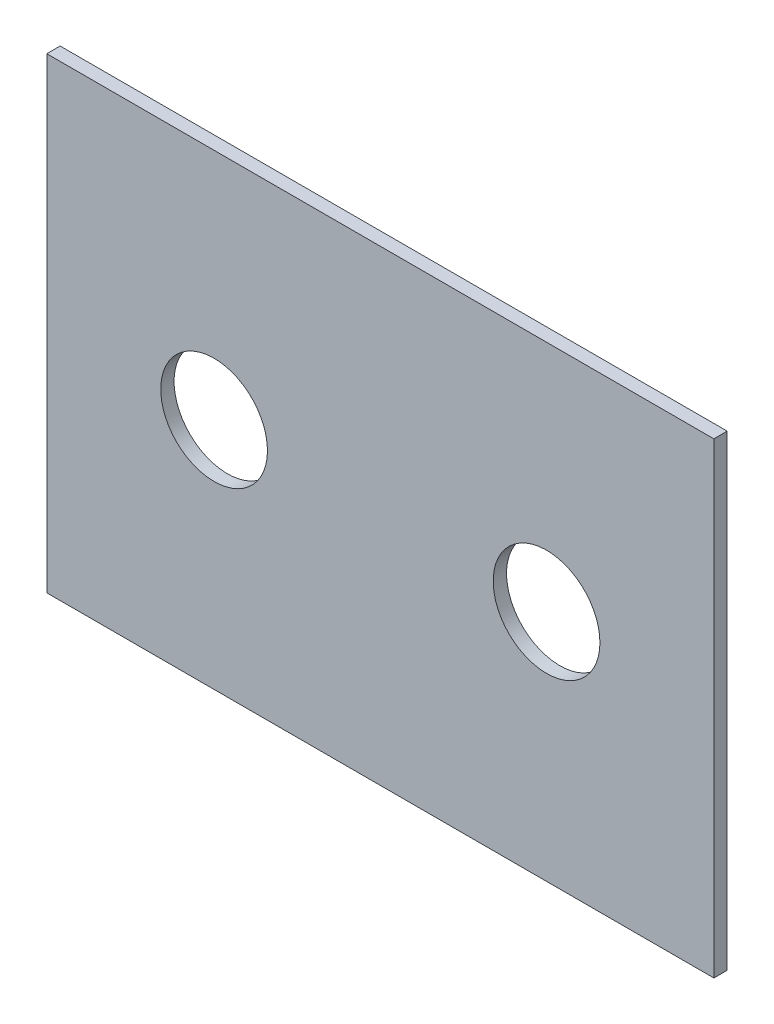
from build123d import *

# Parameters (mm, degrees)
SCHIZZO1_W                   = 50
SCHIZZO1_H                   = 35
ESTRUSIONE_ESTRUSIONE1_DEPTH = 1
FORO_8_0_8_1_D               = 8
FORO_8_0_8_1_DEPTH           = 1
FORO_8_0_8_1_ON_FACE_2_D     = 8
FORO_8_0_8_1_ON_FACE_2_DEPTH = 1


with BuildPart() as part:
    # Schizzo1 → Estrusione-Estrusione1 (new body)
    with BuildSketch(Plane.XY):
        Rectangle(SCHIZZO1_W, SCHIZZO1_H)
    extrude(amount=ESTRUSIONE_ESTRUSIONE1_DEPTH)

    # Foro _8.0 _8_-1
    with Locations(Plane(origin=(-12.459935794, 0, 1), x_dir=(1, 0, 0), z_dir=(0, 0, 1))):
        with Locations((0, 0), (24.919871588, 0)):
            Hole(FORO_8_0_8_1_D / 2, depth=FORO_8_0_8_1_DEPTH)

    # Foro _8.0 _8_-1 on face 2
    with Locations(Plane(origin=(-30.261722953, 7.199441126, 0), x_dir=(1, 0, 0), z_dir=(0, 0, 1))):
        with Locations((0, 0)):
            Hole(FORO_8_0_8_1_ON_FACE_2_D / 2, depth=FORO_8_0_8_1_ON_FACE_2_DEPTH)


solid = part.part
